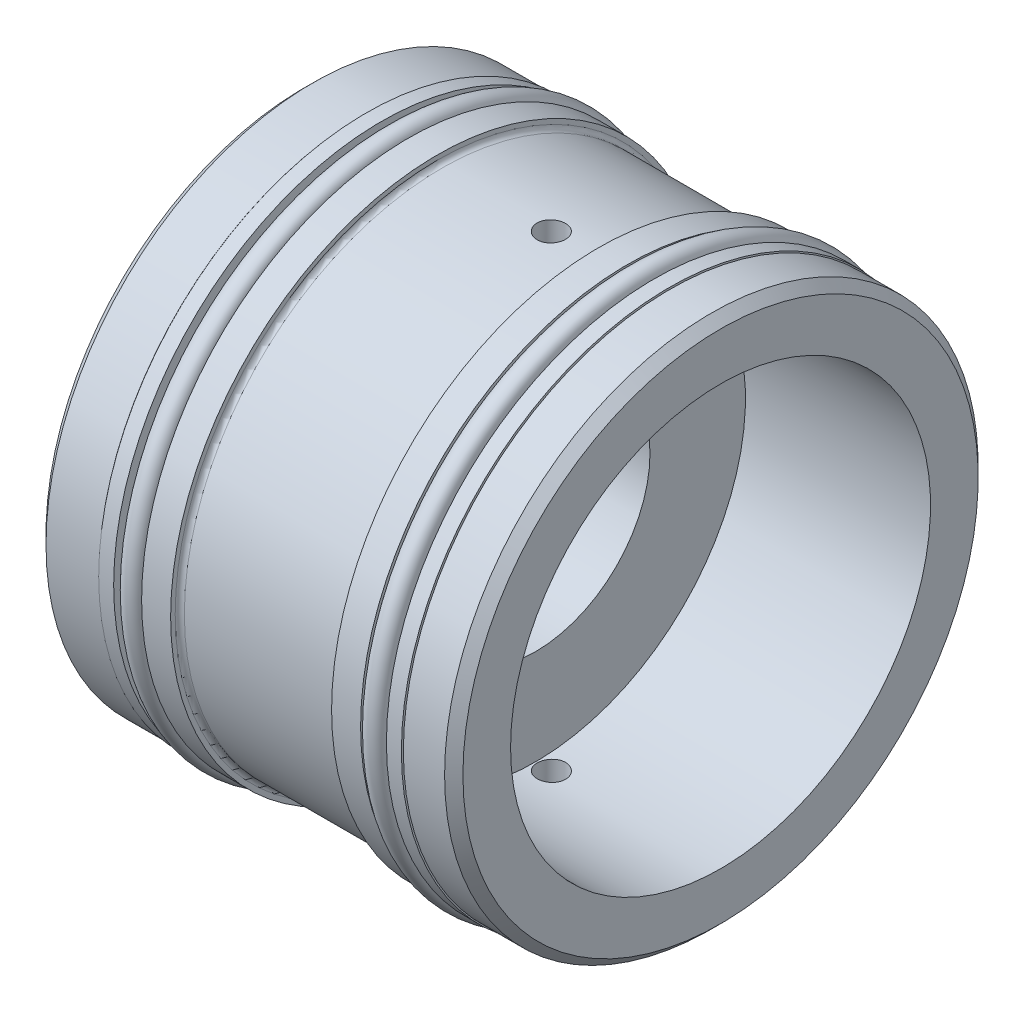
ISO-10303-21;
HEADER;
FILE_DESCRIPTION(('STEP AP214'),'2;1');
FILE_NAME('part.step','',(''),(''),'','','');
FILE_SCHEMA(('AUTOMOTIVE_DESIGN { 1 0 10303 214 1 1 1 1 }'));
ENDSEC;
DATA;
#1=APPLICATION_CONTEXT('core data for automotive mechanical design processes');
#2=APPLICATION_PROTOCOL_DEFINITION('international standard','automotive_design',2000,#1);
#3=PRODUCT_CONTEXT('',#1,'mechanical');
#4=PRODUCT('Part','Part','',(#3));
#5=PRODUCT_RELATED_PRODUCT_CATEGORY('part','',(#4));
#6=PRODUCT_DEFINITION_FORMATION('','',#4);
#7=PRODUCT_DEFINITION_CONTEXT('part definition',#1,'design');
#8=PRODUCT_DEFINITION('design','',#6,#7);
#9=PRODUCT_DEFINITION_SHAPE('','',#8);
#10=(LENGTH_UNIT() NAMED_UNIT(*) SI_UNIT(.MILLI.,.METRE.));
#11=(NAMED_UNIT(*) PLANE_ANGLE_UNIT() SI_UNIT($,.RADIAN.));
#12=(NAMED_UNIT(*) SI_UNIT($,.STERADIAN.) SOLID_ANGLE_UNIT());
#13=UNCERTAINTY_MEASURE_WITH_UNIT(LENGTH_MEASURE(1.E-05),#10,'distance_accuracy_value','');
#14=(GEOMETRIC_REPRESENTATION_CONTEXT(3) GLOBAL_UNCERTAINTY_ASSIGNED_CONTEXT((#13)) GLOBAL_UNIT_ASSIGNED_CONTEXT((#10,
#11,#12)) REPRESENTATION_CONTEXT('',''));
#15=CARTESIAN_POINT('',(0.,0.,0.));
#16=DIRECTION('',(0.,0.,1.));
#17=DIRECTION('',(1.,0.,0.));
#18=AXIS2_PLACEMENT_3D('',#15,#16,#17);
#19=CARTESIAN_POINT('',(0.,0.,0.));
#20=DIRECTION('',(-1.,0.,0.));
#21=DIRECTION('',(0.,0.,1.));
#22=AXIS2_PLACEMENT_3D('',#19,#20,#21);
#23=CYLINDRICAL_SURFACE('',#22,20.9296);
#24=CARTESIAN_POINT('',(10.9138071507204,0.,0.));
#25=DIRECTION('',(-1.,0.,0.));
#26=DIRECTION('',(0.,0.,1.));
#27=AXIS2_PLACEMENT_3D('',#24,#25,#26);
#28=CIRCLE('',#27,20.9296);
#29=CARTESIAN_POINT('',(10.9138071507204,0.,20.9296));
#30=VERTEX_POINT('',#29);
#31=EDGE_CURVE('E146',#30,#30,#28,.T.);
#32=ORIENTED_EDGE('',*,*,#31,.F.);
#33=EDGE_LOOP('',(#32));
#34=FACE_BOUND('',#33,.T.);
#35=CARTESIAN_POINT('',(11.8237,0.,0.));
#36=DIRECTION('',(1.,0.,0.));
#37=DIRECTION('',(0.,0.,-1.));
#38=AXIS2_PLACEMENT_3D('',#35,#36,#37);
#39=CIRCLE('',#38,20.9296);
#40=CARTESIAN_POINT('',(11.8237,0.,-20.9296));
#41=VERTEX_POINT('',#40);
#42=EDGE_CURVE('E10',#41,#41,#39,.T.);
#43=ORIENTED_EDGE('',*,*,#42,.F.);
#44=EDGE_LOOP('',(#43));
#45=FACE_BOUND('',#44,.T.);
#46=ADVANCED_FACE('F31',(#34,#45),#23,.T.);
#47=CARTESIAN_POINT('',(13.1445,0.,0.));
#48=DIRECTION('',(-1.,0.,0.));
#49=DIRECTION('',(0.,0.,1.));
#50=AXIS2_PLACEMENT_3D('',#47,#48,#49);
#51=CIRCLE('',#50,20.9296);
#52=CARTESIAN_POINT('',(13.1445,0.,20.9296));
#53=VERTEX_POINT('',#52);
#54=EDGE_CURVE('E198',#53,#53,#51,.T.);
#55=ORIENTED_EDGE('',*,*,#54,.T.);
#56=EDGE_LOOP('',(#55));
#57=FACE_BOUND('',#56,.T.);
#58=CARTESIAN_POINT('',(13.0683,0.,0.));
#59=DIRECTION('',(-1.,0.,0.));
#60=DIRECTION('',(0.,0.,1.));
#61=AXIS2_PLACEMENT_3D('',#58,#59,#60);
#62=CIRCLE('',#61,20.9296);
#63=CARTESIAN_POINT('',(13.0683,0.,20.9296));
#64=VERTEX_POINT('',#63);
#65=EDGE_CURVE('E43',#64,#64,#62,.T.);
#66=ORIENTED_EDGE('',*,*,#65,.F.);
#67=EDGE_LOOP('',(#66));
#68=FACE_BOUND('',#67,.T.);
#69=ADVANCED_FACE('F118',(#57,#68),#23,.T.);
#70=CARTESIAN_POINT('',(9.5885,0.,0.));
#71=DIRECTION('',(-1.,0.,0.));
#72=DIRECTION('',(0.,0.,1.));
#73=AXIS2_PLACEMENT_3D('',#70,#71,#72);
#74=CIRCLE('',#73,20.9296);
#75=CARTESIAN_POINT('',(9.5885,0.,20.9296));
#76=VERTEX_POINT('',#75);
#77=EDGE_CURVE('E142',#76,#76,#74,.T.);
#78=ORIENTED_EDGE('',*,*,#77,.F.);
#79=EDGE_LOOP('',(#78));
#80=FACE_BOUND('',#79,.T.);
#81=CARTESIAN_POINT('',(10.1935928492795,0.,0.));
#82=DIRECTION('',(1.,0.,0.));
#83=DIRECTION('',(0.,0.,-1.));
#84=AXIS2_PLACEMENT_3D('',#81,#82,#83);
#85=CIRCLE('',#84,20.9296);
#86=CARTESIAN_POINT('',(10.1935928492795,0.,-20.9296));
#87=VERTEX_POINT('',#86);
#88=EDGE_CURVE('E48',#87,#87,#85,.T.);
#89=ORIENTED_EDGE('',*,*,#88,.F.);
#90=EDGE_LOOP('',(#89));
#91=FACE_BOUND('',#90,.T.);
#92=ADVANCED_FACE('F121',(#80,#91),#23,.T.);
#93=CARTESIAN_POINT('',(0.,0.,0.));
#94=DIRECTION('',(-1.,0.,0.));
#95=DIRECTION('',(0.,0.,1.));
#96=AXIS2_PLACEMENT_3D('',#93,#94,#95);
#97=CYLINDRICAL_SURFACE('',#96,20.9296);
#98=CARTESIAN_POINT('',(-10.8585,0.,0.));
#99=DIRECTION('',(-1.,0.,0.));
#100=DIRECTION('',(0.,0.,1.));
#101=AXIS2_PLACEMENT_3D('',#98,#99,#100);
#102=CIRCLE('',#101,20.9296);
#103=CARTESIAN_POINT('',(-10.8585,0.,20.9296));
#104=VERTEX_POINT('',#103);
#105=EDGE_CURVE('E159',#104,#104,#102,.T.);
#106=ORIENTED_EDGE('',*,*,#105,.F.);
#107=EDGE_LOOP('',(#106));
#108=FACE_BOUND('',#107,.T.);
#109=CARTESIAN_POINT('',(-9.94860715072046,0.,0.));
#110=DIRECTION('',(1.,0.,0.));
#111=DIRECTION('',(0.,0.,-1.));
#112=AXIS2_PLACEMENT_3D('',#109,#110,#111);
#113=CIRCLE('',#112,20.9296);
#114=CARTESIAN_POINT('',(-9.94860715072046,0.,-20.9296));
#115=VERTEX_POINT('',#114);
#116=EDGE_CURVE('E148',#115,#115,#113,.T.);
#117=ORIENTED_EDGE('',*,*,#116,.F.);
#118=EDGE_LOOP('',(#117));
#119=FACE_BOUND('',#118,.T.);
#120=ADVANCED_FACE('F131',(#108,#119),#97,.T.);
#121=CARTESIAN_POINT('',(-8.6233,0.,0.));
#122=DIRECTION('',(-1.,0.,0.));
#123=DIRECTION('',(0.,0.,1.));
#124=AXIS2_PLACEMENT_3D('',#121,#122,#123);
#125=CIRCLE('',#124,20.9296);
#126=CARTESIAN_POINT('',(-8.6233,0.,20.9296));
#127=VERTEX_POINT('',#126);
#128=EDGE_CURVE('E214',#127,#127,#125,.T.);
#129=ORIENTED_EDGE('',*,*,#128,.T.);
#130=EDGE_LOOP('',(#129));
#131=FACE_BOUND('',#130,.T.);
#132=CARTESIAN_POINT('',(-9.22839284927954,0.,0.));
#133=DIRECTION('',(-1.,0.,0.));
#134=DIRECTION('',(0.,0.,1.));
#135=AXIS2_PLACEMENT_3D('',#132,#133,#134);
#136=CIRCLE('',#135,20.9296);
#137=CARTESIAN_POINT('',(-9.22839284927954,0.,20.9296));
#138=VERTEX_POINT('',#137);
#139=EDGE_CURVE('E153',#138,#138,#136,.T.);
#140=ORIENTED_EDGE('',*,*,#139,.F.);
#141=EDGE_LOOP('',(#140));
#142=FACE_BOUND('',#141,.T.);
#143=ADVANCED_FACE('F136',(#131,#142),#97,.T.);
#144=CARTESIAN_POINT('',(-12.1793,0.,0.));
#145=DIRECTION('',(-1.,0.,0.));
#146=DIRECTION('',(0.,0.,1.));
#147=AXIS2_PLACEMENT_3D('',#144,#145,#146);
#148=CIRCLE('',#147,20.9296);
#149=CARTESIAN_POINT('',(-12.1793,0.,20.9296));
#150=VERTEX_POINT('',#149);
#151=EDGE_CURVE('E217',#150,#150,#148,.T.);
#152=ORIENTED_EDGE('',*,*,#151,.F.);
#153=EDGE_LOOP('',(#152));
#154=FACE_BOUND('',#153,.T.);
#155=CARTESIAN_POINT('',(-12.1031,0.,0.));
#156=DIRECTION('',(1.,0.,0.));
#157=DIRECTION('',(0.,0.,-1.));
#158=AXIS2_PLACEMENT_3D('',#155,#156,#157);
#159=CIRCLE('',#158,20.9296);
#160=CARTESIAN_POINT('',(-12.1031,0.,-20.9296));
#161=VERTEX_POINT('',#160);
#162=EDGE_CURVE('E156',#161,#161,#159,.T.);
#163=ORIENTED_EDGE('',*,*,#162,.F.);
#164=EDGE_LOOP('',(#163));
#165=FACE_BOUND('',#164,.T.);
#166=ADVANCED_FACE('F97',(#154,#165),#97,.T.);
#167=CARTESIAN_POINT('',(0.,0.,0.));
#168=DIRECTION('',(-1.,0.,0.));
#169=DIRECTION('',(0.,0.,1.));
#170=AXIS2_PLACEMENT_3D('',#167,#168,#169);
#171=CYLINDRICAL_SURFACE('',#170,9.525);
#172=CARTESIAN_POINT('',(1.9431,0.,0.));
#173=DIRECTION('',(-1.,0.,0.));
#174=DIRECTION('',(0.,0.,1.));
#175=AXIS2_PLACEMENT_3D('',#172,#173,#174);
#176=CIRCLE('',#175,9.525);
#177=CARTESIAN_POINT('',(1.9431,0.,9.525));
#178=VERTEX_POINT('',#177);
#179=EDGE_CURVE('E186',#178,#178,#176,.T.);
#180=ORIENTED_EDGE('',*,*,#179,.F.);
#181=EDGE_LOOP('',(#180));
#182=FACE_BOUND('',#181,.T.);
#183=CARTESIAN_POINT('',(-17.3355,0.,0.));
#184=DIRECTION('',(-1.,0.,0.));
#185=DIRECTION('',(0.,0.,1.));
#186=AXIS2_PLACEMENT_3D('',#183,#184,#185);
#187=CIRCLE('',#186,9.525);
#188=CARTESIAN_POINT('',(-17.3355,0.,9.525));
#189=VERTEX_POINT('',#188);
#190=EDGE_CURVE('E223',#189,#189,#187,.T.);
#191=ORIENTED_EDGE('',*,*,#190,.T.);
#192=EDGE_LOOP('',(#191));
#193=FACE_BOUND('',#192,.T.);
#194=ADVANCED_FACE('F93',(#182,#193),#171,.F.);
#195=CARTESIAN_POINT('',(1.9431,9.525,0.));
#196=DIRECTION('',(-1.,0.,0.));
#197=DIRECTION('',(0.,0.,1.));
#198=AXIS2_PLACEMENT_3D('',#195,#196,#197);
#199=PLANE('',#198);
#200=CARTESIAN_POINT('',(1.9431,0.,0.));
#201=DIRECTION('',(-1.,0.,0.));
#202=DIRECTION('',(0.,0.,1.));
#203=AXIS2_PLACEMENT_3D('',#200,#201,#202);
#204=CIRCLE('',#203,17.4625);
#205=CARTESIAN_POINT('',(1.9431,0.,17.4625));
#206=VERTEX_POINT('',#205);
#207=EDGE_CURVE('E189',#206,#206,#204,.T.);
#208=ORIENTED_EDGE('',*,*,#207,.F.);
#209=EDGE_LOOP('',(#208));
#210=FACE_BOUND('',#209,.T.);
#211=ORIENTED_EDGE('',*,*,#179,.T.);
#212=EDGE_LOOP('',(#211));
#213=FACE_BOUND('',#212,.T.);
#214=ADVANCED_FACE('F87',(#210,#213),#199,.F.);
#215=CARTESIAN_POINT('',(0.,0.,0.));
#216=DIRECTION('',(-1.,0.,0.));
#217=DIRECTION('',(0.,0.,1.));
#218=AXIS2_PLACEMENT_3D('',#215,#216,#217);
#219=CYLINDRICAL_SURFACE('',#218,17.4625);
#220=CARTESIAN_POINT('',(3.2639,-17.4225115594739,1.1811));
#221=CARTESIAN_POINT('',(3.19763855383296,-17.4225120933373,1.18109708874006));
#222=CARTESIAN_POINT('',(3.13133099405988,-17.4228936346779,1.1755052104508));
#223=CARTESIAN_POINT('',(3.00054761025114,-17.4243787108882,1.15327882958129));
#224=CARTESIAN_POINT('',(2.93607399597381,-17.4254830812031,1.13663154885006));
#225=CARTESIAN_POINT('',(2.81087179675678,-17.4282881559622,1.0927754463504));
#226=CARTESIAN_POINT('',(2.75014122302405,-17.4299885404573,1.06557229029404));
#227=CARTESIAN_POINT('',(2.63412380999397,-17.4337936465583,1.00138601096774));
#228=CARTESIAN_POINT('',(2.57883574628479,-17.4358982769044,0.964405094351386));
#229=CARTESIAN_POINT('',(2.47516116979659,-17.4402788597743,0.881642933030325));
#230=CARTESIAN_POINT('',(2.42678537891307,-17.442555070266,0.835848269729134));
#231=CARTESIAN_POINT('',(2.33840041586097,-17.4470199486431,0.736786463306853));
#232=CARTESIAN_POINT('',(2.29839159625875,-17.4492086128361,0.683519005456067));
#233=CARTESIAN_POINT('',(2.22784263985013,-17.4532540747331,0.570962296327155));
#234=CARTESIAN_POINT('',(2.19731147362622,-17.455110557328,0.511667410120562));
#235=CARTESIAN_POINT('',(2.14664191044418,-17.4582797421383,0.388778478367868));
#236=CARTESIAN_POINT('',(2.12650338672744,-17.4595924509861,0.325184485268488));
#237=CARTESIAN_POINT('',(2.09722078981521,-17.4615243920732,0.195606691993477));
#238=CARTESIAN_POINT('',(2.08805978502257,-17.4621446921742,0.129626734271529));
#239=CARTESIAN_POINT('',(2.08093997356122,-17.4626255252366,-0.00293710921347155));
#240=CARTESIAN_POINT('',(2.0829810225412,-17.4624860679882,-0.0695209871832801));
#241=CARTESIAN_POINT('',(2.09819344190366,-17.4614639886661,-0.201287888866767));
#242=CARTESIAN_POINT('',(2.1113466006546,-17.4605825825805,-0.26647302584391));
#243=CARTESIAN_POINT('',(2.14838159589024,-17.4581772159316,-0.393708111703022));
#244=CARTESIAN_POINT('',(2.17226350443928,-17.4566532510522,-0.455758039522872));
#245=CARTESIAN_POINT('',(2.23009863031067,-17.4531322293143,-0.575019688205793));
#246=CARTESIAN_POINT('',(2.26406007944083,-17.4511347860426,-0.632227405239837));
#247=CARTESIAN_POINT('',(2.34108426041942,-17.4468915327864,-0.740136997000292));
#248=CARTESIAN_POINT('',(2.38414711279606,-17.4446457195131,-0.790838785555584));
#249=CARTESIAN_POINT('',(2.47825451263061,-17.4401530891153,-0.884403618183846));
#250=CARTESIAN_POINT('',(2.52931487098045,-17.4379062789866,-0.927250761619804));
#251=CARTESIAN_POINT('',(2.63791253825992,-17.4336694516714,-1.00376738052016));
#252=CARTESIAN_POINT('',(2.6954498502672,-17.4316794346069,-1.03743685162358));
#253=CARTESIAN_POINT('',(2.81537849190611,-17.4281809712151,-1.09464135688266));
#254=CARTESIAN_POINT('',(2.87777015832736,-17.4266725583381,-1.11817568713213));
#255=CARTESIAN_POINT('',(3.00563165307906,-17.4243085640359,-1.15443070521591));
#256=CARTESIAN_POINT('',(3.07110143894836,-17.4234529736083,-1.1671515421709));
#257=CARTESIAN_POINT('',(3.20312193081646,-17.4224928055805,-1.18139859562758));
#258=CARTESIAN_POINT('',(3.26967023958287,-17.4223867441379,-1.1829469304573));
#259=CARTESIAN_POINT('',(3.40208070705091,-17.422933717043,-1.1748628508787));
#260=CARTESIAN_POINT('',(3.46794286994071,-17.4235867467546,-1.16523050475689));
#261=CARTESIAN_POINT('',(3.59704870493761,-17.4255769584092,-1.13507687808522));
#262=CARTESIAN_POINT('',(3.66029477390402,-17.4269134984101,-1.11456581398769));
#263=CARTESIAN_POINT('',(3.78244713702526,-17.4301195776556,-1.06324734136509));
#264=CARTESIAN_POINT('',(3.84135338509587,-17.431989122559,-1.03243982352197));
#265=CARTESIAN_POINT('',(3.95325548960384,-17.4360541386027,-0.96134655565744));
#266=CARTESIAN_POINT('',(4.00624192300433,-17.4382501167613,-0.921046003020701));
#267=CARTESIAN_POINT('',(4.10470531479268,-17.4427187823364,-0.832132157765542));
#268=CARTESIAN_POINT('',(4.15018218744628,-17.4449914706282,-0.78351877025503));
#269=CARTESIAN_POINT('',(4.23241042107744,-17.449361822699,-0.679263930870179));
#270=CARTESIAN_POINT('',(4.26914745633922,-17.4514591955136,-0.623611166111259));
#271=CARTESIAN_POINT('',(4.33275509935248,-17.4552384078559,-0.50691412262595));
#272=CARTESIAN_POINT('',(4.3596257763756,-17.4569202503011,-0.445869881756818));
#273=CARTESIAN_POINT('',(4.40271309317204,-17.4596775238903,-0.320175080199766));
#274=CARTESIAN_POINT('',(4.41893875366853,-17.4607534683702,-0.255527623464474));
#275=CARTESIAN_POINT('',(4.44030496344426,-17.4621797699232,-0.124418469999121));
#276=CARTESIAN_POINT('',(4.44544564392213,-17.4625301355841,-0.0579567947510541));
#277=CARTESIAN_POINT('',(4.4444946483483,-17.4624658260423,0.0747525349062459));
#278=CARTESIAN_POINT('',(4.43842537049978,-17.4620526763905,0.141000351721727));
#279=CARTESIAN_POINT('',(4.41527324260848,-17.4605108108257,0.27153386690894));
#280=CARTESIAN_POINT('',(4.39819037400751,-17.459382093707,0.335819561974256));
#281=CARTESIAN_POINT('',(4.35350119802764,-17.4565359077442,0.460606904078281));
#282=CARTESIAN_POINT('',(4.3258950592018,-17.4548184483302,0.52110861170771));
#283=CARTESIAN_POINT('',(4.26094591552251,-17.4509874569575,0.636621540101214));
#284=CARTESIAN_POINT('',(4.22360314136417,-17.4488739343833,0.691632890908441));
#285=CARTESIAN_POINT('',(4.14015747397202,-17.4444834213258,0.794717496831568));
#286=CARTESIAN_POINT('',(4.09403826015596,-17.4422061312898,0.842777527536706));
#287=CARTESIAN_POINT('',(3.9943732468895,-17.4377472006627,0.930490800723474));
#288=CARTESIAN_POINT('',(3.94082563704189,-17.4355655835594,0.970141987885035));
#289=CARTESIAN_POINT('',(3.82775340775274,-17.4315416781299,1.03994662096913));
#290=CARTESIAN_POINT('',(3.76822065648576,-17.4296998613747,1.07008690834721));
#291=CARTESIAN_POINT('',(3.6449698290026,-17.4265700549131,1.11990682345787));
#292=CARTESIAN_POINT('',(3.5812567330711,-17.4252814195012,1.13959865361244));
#293=CARTESIAN_POINT('',(3.47494734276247,-17.4237402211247,1.16286709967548));
#294=CARTESIAN_POINT('',(3.43303752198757,-17.4232815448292,1.16969554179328));
#295=CARTESIAN_POINT('',(3.34872476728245,-17.4226670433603,1.17881292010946));
#296=CARTESIAN_POINT('',(3.30632183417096,-17.4225112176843,1.18110186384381));
#297=CARTESIAN_POINT('',(3.2639,-17.4225115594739,1.1811));
#298=B_SPLINE_CURVE_WITH_KNOTS('',3,(#220,#221,#222,#223,#224,#225,#226,#227,#228,#229,#230,
#231,#232,#233,#234,#235,#236,#237,#238,#239,#240,#241,#242,#243,#244,#245,#246,#247,#248,#249,
#250,#251,#252,#253,#254,#255,#256,#257,#258,#259,#260,#261,#262,#263,#264,#265,#266,#267,#268,
#269,#270,#271,#272,#273,#274,#275,#276,#277,#278,#279,#280,#281,#282,#283,#284,#285,#286,#287,
#288,#289,#290,#291,#292,#293,#294,#295,#296,#297),.UNSPECIFIED.,.T.,.F.,(4,2,2,2,2,2,2,2,2,2,2,
2,2,2,2,2,2,2,2,2,2,2,2,2,2,2,2,2,2,2,2,2,2,2,2,2,2,2,4),(0.,0.198629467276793,0.39748891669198,
0.596241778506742,0.794949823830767,0.993962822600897,1.19298420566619,1.39219339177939,
1.59140014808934,1.7902992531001,1.98919579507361,2.18776699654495,2.38633953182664,
2.58507468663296,2.78381247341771,2.98294823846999,3.18208409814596,3.38123378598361,
3.58038072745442,3.7791333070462,3.977884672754,4.17644971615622,4.3750168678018,
4.5738957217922,4.77277684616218,4.97198175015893,5.17118525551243,5.37021973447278,
5.56925185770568,5.76788673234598,5.9665219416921,6.16515396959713,6.36378129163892,
6.56278165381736,6.7618306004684,6.9611537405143,7.16024358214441,7.2874101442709,
7.41457649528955),.UNSPECIFIED.);
#299=CARTESIAN_POINT('',(3.2639,-17.4225115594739,1.1811));
#300=VERTEX_POINT('',#299);
#301=EDGE_CURVE('E77',#300,#300,#298,.T.);
#302=ORIENTED_EDGE('',*,*,#301,.T.);
#303=EDGE_LOOP('',(#302));
#304=FACE_BOUND('',#303,.T.);
#305=CARTESIAN_POINT('',(3.2639,17.4225115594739,1.1811));
#306=CARTESIAN_POINT('',(3.33016144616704,17.4225120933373,1.18109708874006));
#307=CARTESIAN_POINT('',(3.39646900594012,17.4228936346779,1.1755052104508));
#308=CARTESIAN_POINT('',(3.52725238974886,17.4243787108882,1.15327882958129));
#309=CARTESIAN_POINT('',(3.59172600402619,17.4254830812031,1.13663154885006));
#310=CARTESIAN_POINT('',(3.71692820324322,17.4282881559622,1.0927754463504));
#311=CARTESIAN_POINT('',(3.77765877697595,17.4299885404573,1.06557229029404));
#312=CARTESIAN_POINT('',(3.89367619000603,17.4337936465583,1.00138601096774));
#313=CARTESIAN_POINT('',(3.94896425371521,17.4358982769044,0.964405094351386));
#314=CARTESIAN_POINT('',(4.05263883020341,17.4402788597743,0.881642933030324));
#315=CARTESIAN_POINT('',(4.10101462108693,17.442555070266,0.835848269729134));
#316=CARTESIAN_POINT('',(4.18939958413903,17.4470199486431,0.736786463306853));
#317=CARTESIAN_POINT('',(4.22940840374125,17.4492086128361,0.683519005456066));
#318=CARTESIAN_POINT('',(4.29995736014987,17.4532540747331,0.570962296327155));
#319=CARTESIAN_POINT('',(4.33048852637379,17.455110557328,0.511667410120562));
#320=CARTESIAN_POINT('',(4.38115808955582,17.4582797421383,0.388778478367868));
#321=CARTESIAN_POINT('',(4.40129661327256,17.4595924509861,0.325184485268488));
#322=CARTESIAN_POINT('',(4.43057921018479,17.4615243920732,0.195606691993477));
#323=CARTESIAN_POINT('',(4.43974021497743,17.4621446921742,0.129626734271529));
#324=CARTESIAN_POINT('',(4.44686002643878,17.4626255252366,-0.00293710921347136));
#325=CARTESIAN_POINT('',(4.4448189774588,17.4624860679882,-0.0695209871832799));
#326=CARTESIAN_POINT('',(4.42960655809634,17.4614639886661,-0.201287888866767));
#327=CARTESIAN_POINT('',(4.4164533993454,17.4605825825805,-0.266473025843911));
#328=CARTESIAN_POINT('',(4.37941840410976,17.4581772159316,-0.393708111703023));
#329=CARTESIAN_POINT('',(4.35553649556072,17.4566532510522,-0.455758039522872));
#330=CARTESIAN_POINT('',(4.29770136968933,17.4531322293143,-0.575019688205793));
#331=CARTESIAN_POINT('',(4.26373992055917,17.4511347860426,-0.632227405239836));
#332=CARTESIAN_POINT('',(4.18671573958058,17.4468915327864,-0.740136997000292));
#333=CARTESIAN_POINT('',(4.14365288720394,17.4446457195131,-0.790838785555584));
#334=CARTESIAN_POINT('',(4.04954548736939,17.4401530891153,-0.884403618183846));
#335=CARTESIAN_POINT('',(3.99848512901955,17.4379062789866,-0.927250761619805));
#336=CARTESIAN_POINT('',(3.88988746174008,17.4336694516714,-1.00376738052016));
#337=CARTESIAN_POINT('',(3.8323501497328,17.4316794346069,-1.03743685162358));
#338=CARTESIAN_POINT('',(3.71242150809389,17.4281809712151,-1.09464135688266));
#339=CARTESIAN_POINT('',(3.65002984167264,17.4266725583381,-1.11817568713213));
#340=CARTESIAN_POINT('',(3.52216834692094,17.4243085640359,-1.15443070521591));
#341=CARTESIAN_POINT('',(3.45669856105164,17.4234529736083,-1.1671515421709));
#342=CARTESIAN_POINT('',(3.32467806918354,17.4224928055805,-1.18139859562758));
#343=CARTESIAN_POINT('',(3.25812976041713,17.4223867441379,-1.1829469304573));
#344=CARTESIAN_POINT('',(3.12571929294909,17.422933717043,-1.1748628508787));
#345=CARTESIAN_POINT('',(3.05985713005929,17.4235867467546,-1.16523050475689));
#346=CARTESIAN_POINT('',(2.93075129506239,17.4255769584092,-1.13507687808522));
#347=CARTESIAN_POINT('',(2.86750522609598,17.4269134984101,-1.11456581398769));
#348=CARTESIAN_POINT('',(2.74535286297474,17.4301195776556,-1.06324734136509));
#349=CARTESIAN_POINT('',(2.68644661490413,17.431989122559,-1.03243982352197));
#350=CARTESIAN_POINT('',(2.57454451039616,17.4360541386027,-0.96134655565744));
#351=CARTESIAN_POINT('',(2.52155807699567,17.4382501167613,-0.9210460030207));
#352=CARTESIAN_POINT('',(2.42309468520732,17.4427187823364,-0.832132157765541));
#353=CARTESIAN_POINT('',(2.37761781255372,17.4449914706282,-0.78351877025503));
#354=CARTESIAN_POINT('',(2.29538957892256,17.449361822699,-0.679263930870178));
#355=CARTESIAN_POINT('',(2.25865254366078,17.4514591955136,-0.623611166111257));
#356=CARTESIAN_POINT('',(2.19504490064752,17.4552384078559,-0.506914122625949));
#357=CARTESIAN_POINT('',(2.16817422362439,17.4569202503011,-0.445869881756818));
#358=CARTESIAN_POINT('',(2.12508690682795,17.4596775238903,-0.320175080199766));
#359=CARTESIAN_POINT('',(2.10886124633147,17.4607534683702,-0.255527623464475));
#360=CARTESIAN_POINT('',(2.08749503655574,17.4621797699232,-0.124418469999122));
#361=CARTESIAN_POINT('',(2.08235435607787,17.4625301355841,-0.0579567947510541));
#362=CARTESIAN_POINT('',(2.0833053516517,17.4624658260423,0.0747525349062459));
#363=CARTESIAN_POINT('',(2.08937462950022,17.4620526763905,0.141000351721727));
#364=CARTESIAN_POINT('',(2.11252675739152,17.4605108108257,0.27153386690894));
#365=CARTESIAN_POINT('',(2.12960962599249,17.459382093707,0.335819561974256));
#366=CARTESIAN_POINT('',(2.17429880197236,17.4565359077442,0.460606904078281));
#367=CARTESIAN_POINT('',(2.2019049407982,17.4548184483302,0.52110861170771));
#368=CARTESIAN_POINT('',(2.26685408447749,17.4509874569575,0.636621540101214));
#369=CARTESIAN_POINT('',(2.30419685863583,17.4488739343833,0.691632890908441));
#370=CARTESIAN_POINT('',(2.38764252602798,17.4444834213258,0.794717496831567));
#371=CARTESIAN_POINT('',(2.43376173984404,17.4422061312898,0.842777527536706));
#372=CARTESIAN_POINT('',(2.5334267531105,17.4377472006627,0.930490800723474));
#373=CARTESIAN_POINT('',(2.58697436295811,17.4355655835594,0.970141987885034));
#374=CARTESIAN_POINT('',(2.70004659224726,17.4315416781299,1.03994662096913));
#375=CARTESIAN_POINT('',(2.75957934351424,17.4296998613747,1.07008690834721));
#376=CARTESIAN_POINT('',(2.8828301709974,17.4265700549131,1.11990682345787));
#377=CARTESIAN_POINT('',(2.9465432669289,17.4252814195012,1.13959865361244));
#378=CARTESIAN_POINT('',(3.05285265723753,17.4237402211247,1.16286709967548));
#379=CARTESIAN_POINT('',(3.09476247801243,17.4232815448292,1.16969554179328));
#380=CARTESIAN_POINT('',(3.17907523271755,17.4226670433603,1.17881292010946));
#381=CARTESIAN_POINT('',(3.22147816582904,17.4225112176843,1.18110186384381));
#382=CARTESIAN_POINT('',(3.2639,17.4225115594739,1.1811));
#383=B_SPLINE_CURVE_WITH_KNOTS('',3,(#305,#306,#307,#308,#309,#310,#311,#312,#313,#314,#315,
#316,#317,#318,#319,#320,#321,#322,#323,#324,#325,#326,#327,#328,#329,#330,#331,#332,#333,#334,
#335,#336,#337,#338,#339,#340,#341,#342,#343,#344,#345,#346,#347,#348,#349,#350,#351,#352,#353,
#354,#355,#356,#357,#358,#359,#360,#361,#362,#363,#364,#365,#366,#367,#368,#369,#370,#371,#372,
#373,#374,#375,#376,#377,#378,#379,#380,#381,#382),.UNSPECIFIED.,.T.,.F.,(4,2,2,2,2,2,2,2,2,2,2,
2,2,2,2,2,2,2,2,2,2,2,2,2,2,2,2,2,2,2,2,2,2,2,2,2,2,2,4),(0.,0.198629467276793,0.39748891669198,
0.596241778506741,0.794949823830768,0.993962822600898,1.19298420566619,1.39219339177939,
1.59140014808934,1.7902992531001,1.98919579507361,2.18776699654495,2.38633953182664,
2.58507468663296,2.78381247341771,2.98294823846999,3.18208409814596,3.38123378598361,
3.58038072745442,3.7791333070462,3.977884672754,4.17644971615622,4.37501686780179,
4.5738957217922,4.77277684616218,4.97198175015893,5.17118525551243,5.37021973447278,
5.56925185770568,5.76788673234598,5.9665219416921,6.16515396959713,6.36378129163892,
6.56278165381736,6.7618306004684,6.9611537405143,7.1602435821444,7.28741014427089,
7.41457649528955),.UNSPECIFIED.);
#384=CARTESIAN_POINT('',(3.2639,17.4225115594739,1.1811));
#385=VERTEX_POINT('',#384);
#386=EDGE_CURVE('E72',#385,#385,#383,.T.);
#387=ORIENTED_EDGE('',*,*,#386,.T.);
#388=EDGE_LOOP('',(#387));
#389=FACE_BOUND('',#388,.T.);
#390=CARTESIAN_POINT('',(17.3355,0.,0.));
#391=DIRECTION('',(-1.,0.,0.));
#392=DIRECTION('',(0.,0.,1.));
#393=AXIS2_PLACEMENT_3D('',#390,#391,#392);
#394=CIRCLE('',#393,17.4625);
#395=CARTESIAN_POINT('',(17.3355,0.,17.4625));
#396=VERTEX_POINT('',#395);
#397=EDGE_CURVE('E192',#396,#396,#394,.T.);
#398=ORIENTED_EDGE('',*,*,#397,.F.);
#399=EDGE_LOOP('',(#398));
#400=FACE_BOUND('',#399,.T.);
#401=ORIENTED_EDGE('',*,*,#207,.T.);
#402=EDGE_LOOP('',(#401));
#403=FACE_BOUND('',#402,.T.);
#404=ADVANCED_FACE('F81',(#304,#389,#400,#403),#219,.F.);
#405=CARTESIAN_POINT('',(17.3355,22.1869,0.));
#406=DIRECTION('',(-1.,0.,0.));
#407=DIRECTION('',(0.,0.,1.));
#408=AXIS2_PLACEMENT_3D('',#405,#406,#407);
#409=PLANE('',#408);
#410=CARTESIAN_POINT('',(17.3355,0.,0.));
#411=DIRECTION('',(-1.,0.,0.));
#412=DIRECTION('',(0.,0.,1.));
#413=AXIS2_PLACEMENT_3D('',#410,#411,#412);
#414=CIRCLE('',#413,21.4249);
#415=CARTESIAN_POINT('',(17.3355,0.,21.4249));
#416=VERTEX_POINT('',#415);
#417=EDGE_CURVE('E168',#416,#416,#414,.F.);
#418=ORIENTED_EDGE('',*,*,#417,.T.);
#419=EDGE_LOOP('',(#418));
#420=FACE_BOUND('',#419,.T.);
#421=ORIENTED_EDGE('',*,*,#397,.T.);
#422=EDGE_LOOP('',(#421));
#423=FACE_BOUND('',#422,.T.);
#424=ADVANCED_FACE('F86',(#420,#423),#409,.F.);
#425=CARTESIAN_POINT('',(0.,0.,0.));
#426=DIRECTION('',(-1.,0.,0.));
#427=DIRECTION('',(0.,0.,1.));
#428=AXIS2_PLACEMENT_3D('',#425,#426,#427);
#429=CYLINDRICAL_SURFACE('',#428,22.1869);
#430=CARTESIAN_POINT('',(16.5735,0.,0.));
#431=DIRECTION('',(-1.,0.,0.));
#432=DIRECTION('',(0.,0.,1.));
#433=AXIS2_PLACEMENT_3D('',#430,#431,#432);
#434=CIRCLE('',#433,22.1869);
#435=CARTESIAN_POINT('',(16.5735,0.,22.1869));
#436=VERTEX_POINT('',#435);
#437=EDGE_CURVE('E171',#436,#436,#434,.T.);
#438=ORIENTED_EDGE('',*,*,#437,.T.);
#439=EDGE_LOOP('',(#438));
#440=FACE_BOUND('',#439,.T.);
#441=CARTESIAN_POINT('',(13.1445,0.,0.));
#442=DIRECTION('',(-1.,0.,0.));
#443=DIRECTION('',(0.,0.,1.));
#444=AXIS2_PLACEMENT_3D('',#441,#442,#443);
#445=CIRCLE('',#444,22.1869);
#446=CARTESIAN_POINT('',(13.1445,0.,22.1869));
#447=VERTEX_POINT('',#446);
#448=EDGE_CURVE('E195',#447,#447,#445,.T.);
#449=ORIENTED_EDGE('',*,*,#448,.F.);
#450=EDGE_LOOP('',(#449));
#451=FACE_BOUND('',#450,.T.);
#452=ADVANCED_FACE('F418',(#440,#451),#429,.T.);
#453=CARTESIAN_POINT('',(13.1445,22.1869,0.));
#454=DIRECTION('',(1.,0.,0.));
#455=DIRECTION('',(0.,0.,-1.));
#456=AXIS2_PLACEMENT_3D('',#453,#454,#455);
#457=PLANE('',#456);
#458=ORIENTED_EDGE('',*,*,#54,.F.);
#459=EDGE_LOOP('',(#458));
#460=FACE_BOUND('',#459,.T.);
#461=ORIENTED_EDGE('',*,*,#448,.T.);
#462=EDGE_LOOP('',(#461));
#463=FACE_BOUND('',#462,.T.);
#464=ADVANCED_FACE('F426',(#460,#463),#457,.F.);
#465=CARTESIAN_POINT('',(9.5885,20.9296,0.));
#466=DIRECTION('',(-1.,0.,0.));
#467=DIRECTION('',(0.,0.,1.));
#468=AXIS2_PLACEMENT_3D('',#465,#466,#467);
#469=PLANE('',#468);
#470=CARTESIAN_POINT('',(9.5885,0.,0.));
#471=DIRECTION('',(-1.,0.,0.));
#472=DIRECTION('',(0.,0.,1.));
#473=AXIS2_PLACEMENT_3D('',#470,#471,#472);
#474=CIRCLE('',#473,22.1869);
#475=CARTESIAN_POINT('',(9.5885,0.,22.1869));
#476=VERTEX_POINT('',#475);
#477=EDGE_CURVE('E202',#476,#476,#474,.T.);
#478=ORIENTED_EDGE('',*,*,#477,.F.);
#479=EDGE_LOOP('',(#478));
#480=FACE_BOUND('',#479,.T.);
#481=ORIENTED_EDGE('',*,*,#77,.T.);
#482=EDGE_LOOP('',(#481));
#483=FACE_BOUND('',#482,.T.);
#484=ADVANCED_FACE('F433',(#480,#483),#469,.F.);
#485=CARTESIAN_POINT('',(0.,0.,0.));
#486=DIRECTION('',(-1.,0.,0.));
#487=DIRECTION('',(0.,0.,1.));
#488=AXIS2_PLACEMENT_3D('',#485,#486,#487);
#489=CYLINDRICAL_SURFACE('',#488,22.1869);
#490=CARTESIAN_POINT('',(7.1755,0.,0.));
#491=DIRECTION('',(-1.,0.,0.));
#492=DIRECTION('',(0.,0.,1.));
#493=AXIS2_PLACEMENT_3D('',#490,#491,#492);
#494=CIRCLE('',#493,22.1869);
#495=CARTESIAN_POINT('',(7.1755,0.,22.1869));
#496=VERTEX_POINT('',#495);
#497=EDGE_CURVE('E205',#496,#496,#494,.T.);
#498=ORIENTED_EDGE('',*,*,#497,.F.);
#499=EDGE_LOOP('',(#498));
#500=FACE_BOUND('',#499,.T.);
#501=ORIENTED_EDGE('',*,*,#477,.T.);
#502=EDGE_LOOP('',(#501));
#503=FACE_BOUND('',#502,.T.);
#504=ADVANCED_FACE('F293',(#500,#503),#489,.T.);
#505=CARTESIAN_POINT('',(7.1755,22.1869,0.));
#506=DIRECTION('',(1.,0.,0.));
#507=DIRECTION('',(0.,0.,-1.));
#508=AXIS2_PLACEMENT_3D('',#505,#506,#507);
#509=PLANE('',#508);
#510=CARTESIAN_POINT('',(7.1755,0.,0.));
#511=DIRECTION('',(1.,0.,0.));
#512=DIRECTION('',(0.,0.,-1.));
#513=AXIS2_PLACEMENT_3D('',#510,#511,#512);
#514=CIRCLE('',#513,21.8059);
#515=CARTESIAN_POINT('',(7.1755,0.,-21.8059));
#516=VERTEX_POINT('',#515);
#517=EDGE_CURVE('E177',#516,#516,#514,.T.);
#518=ORIENTED_EDGE('',*,*,#517,.T.);
#519=EDGE_LOOP('',(#518));
#520=FACE_BOUND('',#519,.T.);
#521=ORIENTED_EDGE('',*,*,#497,.T.);
#522=EDGE_LOOP('',(#521));
#523=FACE_BOUND('',#522,.T.);
#524=ADVANCED_FACE('F283',(#520,#523),#509,.F.);
#525=CARTESIAN_POINT('',(0.,0.,0.));
#526=DIRECTION('',(-1.,0.,0.));
#527=DIRECTION('',(0.,0.,1.));
#528=AXIS2_PLACEMENT_3D('',#525,#526,#527);
#529=CYLINDRICAL_SURFACE('',#528,21.4249);
#530=CARTESIAN_POINT('',(3.2639,-21.3923197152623,1.1811));
#531=CARTESIAN_POINT('',(3.3301888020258,-21.3923201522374,1.18109707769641));
#532=CARTESIAN_POINT('',(3.39652438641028,-21.3926311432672,1.17550060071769));
#533=CARTESIAN_POINT('',(3.5273649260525,-21.393841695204,1.15325488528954));
#534=CARTESIAN_POINT('',(3.59186764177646,-21.3947419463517,1.13659268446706));
#535=CARTESIAN_POINT('',(3.71712819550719,-21.3970287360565,1.09269462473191));
#536=CARTESIAN_POINT('',(3.77788794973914,-21.3984150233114,1.06546422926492));
#537=CARTESIAN_POINT('',(3.89395795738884,-21.4015173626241,1.0012113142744));
#538=CARTESIAN_POINT('',(3.94926947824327,-21.4032333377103,0.964191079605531));
#539=CARTESIAN_POINT('',(4.05295557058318,-21.4068040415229,0.881360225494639));
#540=CARTESIAN_POINT('',(4.10132276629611,-21.4086589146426,0.835540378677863));
#541=CARTESIAN_POINT('',(4.18968425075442,-21.4122970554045,0.736429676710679));
#542=CARTESIAN_POINT('',(4.2296781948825,-21.4140803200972,0.683138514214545));
#543=CARTESIAN_POINT('',(4.30017919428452,-21.4173754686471,0.570558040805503));
#544=CARTESIAN_POINT('',(4.33068035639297,-21.4188871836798,0.511265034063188));
#545=CARTESIAN_POINT('',(4.38129219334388,-21.4214674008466,0.38838996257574));
#546=CARTESIAN_POINT('',(4.4014029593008,-21.4225359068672,0.324807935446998));
#547=CARTESIAN_POINT('',(4.43064324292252,-21.4241083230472,0.195228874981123));
#548=CARTESIAN_POINT('',(4.43978401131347,-21.4246128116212,0.129234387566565));
#549=CARTESIAN_POINT('',(4.44685955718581,-21.4250022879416,-0.00335405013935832));
#550=CARTESIAN_POINT('',(4.44479443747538,-21.4248872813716,-0.0699479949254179));
#551=CARTESIAN_POINT('',(4.42952614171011,-21.4240512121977,-0.201768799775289));
#552=CARTESIAN_POINT('',(4.41633507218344,-21.4233308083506,-0.266997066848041));
#553=CARTESIAN_POINT('',(4.37920809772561,-21.4213658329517,-0.394312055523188));
#554=CARTESIAN_POINT('',(4.35527214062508,-21.4201212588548,-0.456398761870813));
#555=CARTESIAN_POINT('',(4.29732107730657,-21.4172469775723,-0.575707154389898));
#556=CARTESIAN_POINT('',(4.26330046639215,-21.4156170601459,-0.632926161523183));
#557=CARTESIAN_POINT('',(4.18614982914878,-21.4121556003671,-0.740845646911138));
#558=CARTESIAN_POINT('',(4.1430197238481,-21.4103240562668,-0.791546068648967));
#559=CARTESIAN_POINT('',(4.04880598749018,-21.4066626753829,-0.885059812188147));
#560=CARTESIAN_POINT('',(3.99771185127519,-21.4048328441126,-0.927862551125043));
#561=CARTESIAN_POINT('',(3.88905729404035,-21.4013836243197,-1.00428436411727));
#562=CARTESIAN_POINT('',(3.83149687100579,-21.3997642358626,-1.03790343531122));
#563=CARTESIAN_POINT('',(3.71153715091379,-21.3969187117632,-1.09500273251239));
#564=CARTESIAN_POINT('',(3.64913765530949,-21.3956925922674,-1.11848254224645));
#565=CARTESIAN_POINT('',(3.52127404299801,-21.3937724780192,-1.15462965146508));
#566=CARTESIAN_POINT('',(3.45580995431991,-21.393078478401,-1.16729704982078));
#567=CARTESIAN_POINT('',(3.32376767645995,-21.3923017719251,-1.18144662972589));
#568=CARTESIAN_POINT('',(3.25719106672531,-21.3922182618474,-1.18294350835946));
#569=CARTESIAN_POINT('',(3.12473253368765,-21.3926698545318,-1.17474792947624));
#570=CARTESIAN_POINT('',(3.05885060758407,-21.3932049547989,-1.16505551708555));
#571=CARTESIAN_POINT('',(2.92969297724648,-21.394832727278,-1.13476868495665));
#572=CARTESIAN_POINT('',(2.86641568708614,-21.3959250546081,-1.11418100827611));
#573=CARTESIAN_POINT('',(2.74421464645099,-21.3985438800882,-1.06269488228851));
#574=CARTESIAN_POINT('',(2.68529092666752,-21.4000703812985,-1.0317963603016));
#575=CARTESIAN_POINT('',(2.57340207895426,-21.4033874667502,-0.960527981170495));
#576=CARTESIAN_POINT('',(2.52044324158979,-21.4051783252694,-0.920148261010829));
#577=CARTESIAN_POINT('',(2.42205077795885,-21.4088213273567,-0.831078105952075));
#578=CARTESIAN_POINT('',(2.37661720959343,-21.4106734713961,-0.78238760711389));
#579=CARTESIAN_POINT('',(2.29451548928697,-21.4142326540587,-0.678014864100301));
#580=CARTESIAN_POINT('',(2.25785683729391,-21.415939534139,-0.622325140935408));
#581=CARTESIAN_POINT('',(2.19441052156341,-21.4190135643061,-0.50557250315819));
#582=CARTESIAN_POINT('',(2.16762280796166,-21.4203807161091,-0.444509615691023));
#583=CARTESIAN_POINT('',(2.12469535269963,-21.422620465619,-0.318779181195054));
#584=CARTESIAN_POINT('',(2.10854955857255,-21.423493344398,-0.254113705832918));
#585=CARTESIAN_POINT('',(2.08734444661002,-21.4246473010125,-0.122984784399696));
#586=CARTESIAN_POINT('',(2.08228504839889,-21.4249283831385,-0.0565213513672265));
#587=CARTESIAN_POINT('',(2.08339710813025,-21.4248670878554,0.0762226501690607));
#588=CARTESIAN_POINT('',(2.08955367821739,-21.4245255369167,0.142503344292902));
#589=CARTESIAN_POINT('',(2.11289209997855,-21.4232590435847,0.273088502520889));
#590=CARTESIAN_POINT('',(2.13007397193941,-21.4223341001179,0.337392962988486));
#591=CARTESIAN_POINT('',(2.17497208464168,-21.4200048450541,0.462203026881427));
#592=CARTESIAN_POINT('',(2.20268835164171,-21.418600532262,0.522708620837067));
#593=CARTESIAN_POINT('',(2.26786615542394,-21.4154703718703,0.638209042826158));
#594=CARTESIAN_POINT('',(2.30532741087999,-21.413744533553,0.69320402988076));
#595=CARTESIAN_POINT('',(2.38898595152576,-21.410162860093,0.796197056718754));
#596=CARTESIAN_POINT('',(2.43519380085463,-21.4083068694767,0.844186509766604));
#597=CARTESIAN_POINT('',(2.53502338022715,-21.4046752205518,0.931742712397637));
#598=CARTESIAN_POINT('',(2.58864692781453,-21.4028995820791,0.97130739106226));
#599=CARTESIAN_POINT('',(2.70183519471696,-21.399627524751,1.04091360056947));
#600=CARTESIAN_POINT('',(2.76140619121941,-21.3981314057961,1.07094492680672));
#601=CARTESIAN_POINT('',(2.88470895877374,-21.395591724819,1.12054330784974));
#602=CARTESIAN_POINT('',(2.94843573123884,-21.3945476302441,1.1401226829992));
#603=CARTESIAN_POINT('',(3.0544467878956,-21.3933052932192,1.16314357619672));
#604=CARTESIAN_POINT('',(3.09604493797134,-21.3929373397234,1.16986859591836));
#605=CARTESIAN_POINT('',(3.17972243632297,-21.3924444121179,1.1788477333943));
#606=CARTESIAN_POINT('',(3.22180178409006,-21.3923194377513,1.18110185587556));
#607=CARTESIAN_POINT('',(3.2639,-21.3923197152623,1.1811));
#608=B_SPLINE_CURVE_WITH_KNOTS('',3,(#530,#531,#532,#533,#534,#535,#536,#537,#538,#539,#540,
#541,#542,#543,#544,#545,#546,#547,#548,#549,#550,#551,#552,#553,#554,#555,#556,#557,#558,#559,
#560,#561,#562,#563,#564,#565,#566,#567,#568,#569,#570,#571,#572,#573,#574,#575,#576,#577,#578,
#579,#580,#581,#582,#583,#584,#585,#586,#587,#588,#589,#590,#591,#592,#593,#594,#595,#596,#597,
#598,#599,#600,#601,#602,#603,#604,#605,#606,#607),.UNSPECIFIED.,.T.,.F.,(4,2,2,2,2,2,2,2,2,2,2,
2,2,2,2,2,2,2,2,2,2,2,2,2,2,2,2,2,2,2,2,2,2,2,2,2,2,2,4),(0.,0.198712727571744,
0.397658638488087,0.596501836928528,0.795298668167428,0.994305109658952,1.19331974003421,
1.39245767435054,1.59159386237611,1.7905256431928,1.98945559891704,2.18816937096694,
2.38688410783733,2.58570751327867,2.78453264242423,2.98362229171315,3.182712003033,
3.38180988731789,3.5809059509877,3.77974001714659,3.97857328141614,4.17728363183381,
4.37599538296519,4.57491477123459,4.77383568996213,4.97297100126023,5.172105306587,
5.37112625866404,5.57014576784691,5.76890129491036,5.96765718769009,6.16641357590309,
6.36516422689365,6.56415647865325,6.76319758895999,6.96245104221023,7.16146910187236,
7.28766628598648,7.41386333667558),.UNSPECIFIED.);
#609=CARTESIAN_POINT('',(3.2639,-21.3923197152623,1.1811));
#610=VERTEX_POINT('',#609);
#611=EDGE_CURVE('E35',#610,#610,#608,.T.);
#612=ORIENTED_EDGE('',*,*,#611,.T.);
#613=EDGE_LOOP('',(#612));
#614=FACE_BOUND('',#613,.T.);
#615=CARTESIAN_POINT('',(3.2639,21.3923197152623,1.1811));
#616=CARTESIAN_POINT('',(3.1976111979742,21.3923201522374,1.18109707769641));
#617=CARTESIAN_POINT('',(3.13127561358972,21.3926311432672,1.17550060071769));
#618=CARTESIAN_POINT('',(3.0004350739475,21.393841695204,1.15325488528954));
#619=CARTESIAN_POINT('',(2.93593235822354,21.3947419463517,1.13659268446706));
#620=CARTESIAN_POINT('',(2.81067180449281,21.3970287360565,1.09269462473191));
#621=CARTESIAN_POINT('',(2.74991205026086,21.3984150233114,1.06546422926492));
#622=CARTESIAN_POINT('',(2.63384204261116,21.4015173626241,1.0012113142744));
#623=CARTESIAN_POINT('',(2.57853052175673,21.4032333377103,0.964191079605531));
#624=CARTESIAN_POINT('',(2.47484442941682,21.4068040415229,0.881360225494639));
#625=CARTESIAN_POINT('',(2.42647723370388,21.4086589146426,0.835540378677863));
#626=CARTESIAN_POINT('',(2.33811574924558,21.4122970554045,0.736429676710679));
#627=CARTESIAN_POINT('',(2.2981218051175,21.4140803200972,0.683138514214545));
#628=CARTESIAN_POINT('',(2.22762080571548,21.4173754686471,0.570558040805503));
#629=CARTESIAN_POINT('',(2.19711964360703,21.4188871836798,0.511265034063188));
#630=CARTESIAN_POINT('',(2.14650780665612,21.4214674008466,0.38838996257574));
#631=CARTESIAN_POINT('',(2.1263970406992,21.4225359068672,0.324807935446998));
#632=CARTESIAN_POINT('',(2.09715675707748,21.4241083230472,0.195228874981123));
#633=CARTESIAN_POINT('',(2.08801598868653,21.4246128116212,0.129234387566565));
#634=CARTESIAN_POINT('',(2.08094044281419,21.4250022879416,-0.00335405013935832));
#635=CARTESIAN_POINT('',(2.08300556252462,21.4248872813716,-0.0699479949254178));
#636=CARTESIAN_POINT('',(2.09827385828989,21.4240512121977,-0.201768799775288));
#637=CARTESIAN_POINT('',(2.11146492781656,21.4233308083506,-0.26699706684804));
#638=CARTESIAN_POINT('',(2.14859190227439,21.4213658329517,-0.394312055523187));
#639=CARTESIAN_POINT('',(2.17252785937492,21.4201212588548,-0.456398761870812));
#640=CARTESIAN_POINT('',(2.23047892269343,21.4172469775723,-0.575707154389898));
#641=CARTESIAN_POINT('',(2.26449953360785,21.4156170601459,-0.632926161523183));
#642=CARTESIAN_POINT('',(2.34165017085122,21.4121556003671,-0.740845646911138));
#643=CARTESIAN_POINT('',(2.3847802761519,21.4103240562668,-0.791546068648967));
#644=CARTESIAN_POINT('',(2.47899401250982,21.4066626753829,-0.885059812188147));
#645=CARTESIAN_POINT('',(2.53008814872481,21.4048328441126,-0.927862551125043));
#646=CARTESIAN_POINT('',(2.63874270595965,21.4013836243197,-1.00428436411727));
#647=CARTESIAN_POINT('',(2.69630312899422,21.3997642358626,-1.03790343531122));
#648=CARTESIAN_POINT('',(2.81626284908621,21.3969187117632,-1.09500273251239));
#649=CARTESIAN_POINT('',(2.87866234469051,21.3956925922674,-1.11848254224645));
#650=CARTESIAN_POINT('',(3.00652595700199,21.3937724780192,-1.15462965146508));
#651=CARTESIAN_POINT('',(3.07199004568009,21.393078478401,-1.16729704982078));
#652=CARTESIAN_POINT('',(3.20403232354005,21.3923017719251,-1.18144662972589));
#653=CARTESIAN_POINT('',(3.27060893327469,21.3922182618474,-1.18294350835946));
#654=CARTESIAN_POINT('',(3.40306746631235,21.3926698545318,-1.17474792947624));
#655=CARTESIAN_POINT('',(3.46894939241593,21.3932049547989,-1.16505551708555));
#656=CARTESIAN_POINT('',(3.59810702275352,21.394832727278,-1.13476868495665));
#657=CARTESIAN_POINT('',(3.66138431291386,21.3959250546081,-1.11418100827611));
#658=CARTESIAN_POINT('',(3.78358535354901,21.3985438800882,-1.06269488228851));
#659=CARTESIAN_POINT('',(3.84250907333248,21.4000703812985,-1.0317963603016));
#660=CARTESIAN_POINT('',(3.95439792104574,21.4033874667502,-0.960527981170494));
#661=CARTESIAN_POINT('',(4.00735675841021,21.4051783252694,-0.920148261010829));
#662=CARTESIAN_POINT('',(4.10574922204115,21.4088213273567,-0.831078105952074));
#663=CARTESIAN_POINT('',(4.15118279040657,21.4106734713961,-0.782387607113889));
#664=CARTESIAN_POINT('',(4.23328451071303,21.4142326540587,-0.6780148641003));
#665=CARTESIAN_POINT('',(4.26994316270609,21.415939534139,-0.622325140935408));
#666=CARTESIAN_POINT('',(4.33338947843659,21.4190135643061,-0.50557250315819));
#667=CARTESIAN_POINT('',(4.36017719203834,21.4203807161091,-0.444509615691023));
#668=CARTESIAN_POINT('',(4.40310464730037,21.422620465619,-0.318779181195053));
#669=CARTESIAN_POINT('',(4.41925044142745,21.423493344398,-0.254113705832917));
#670=CARTESIAN_POINT('',(4.44045555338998,21.4246473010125,-0.122984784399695));
#671=CARTESIAN_POINT('',(4.44551495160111,21.4249283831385,-0.0565213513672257));
#672=CARTESIAN_POINT('',(4.44440289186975,21.4248670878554,0.0762226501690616));
#673=CARTESIAN_POINT('',(4.43824632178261,21.4245255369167,0.142503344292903));
#674=CARTESIAN_POINT('',(4.41490790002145,21.4232590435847,0.27308850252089));
#675=CARTESIAN_POINT('',(4.39772602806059,21.4223341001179,0.337392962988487));
#676=CARTESIAN_POINT('',(4.35282791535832,21.4200048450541,0.462203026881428));
#677=CARTESIAN_POINT('',(4.32511164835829,21.418600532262,0.522708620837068));
#678=CARTESIAN_POINT('',(4.25993384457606,21.4154703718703,0.638209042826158));
#679=CARTESIAN_POINT('',(4.22247258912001,21.413744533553,0.69320402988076));
#680=CARTESIAN_POINT('',(4.13881404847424,21.410162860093,0.796197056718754));
#681=CARTESIAN_POINT('',(4.09260619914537,21.4083068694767,0.844186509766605));
#682=CARTESIAN_POINT('',(3.99277661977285,21.4046752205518,0.931742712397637));
#683=CARTESIAN_POINT('',(3.93915307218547,21.4028995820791,0.97130739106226));
#684=CARTESIAN_POINT('',(3.82596480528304,21.399627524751,1.04091360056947));
#685=CARTESIAN_POINT('',(3.76639380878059,21.3981314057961,1.07094492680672));
#686=CARTESIAN_POINT('',(3.64309104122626,21.395591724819,1.12054330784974));
#687=CARTESIAN_POINT('',(3.57936426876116,21.3945476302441,1.1401226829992));
#688=CARTESIAN_POINT('',(3.4733532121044,21.3933052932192,1.16314357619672));
#689=CARTESIAN_POINT('',(3.43175506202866,21.3929373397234,1.16986859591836));
#690=CARTESIAN_POINT('',(3.34807756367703,21.3924444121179,1.1788477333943));
#691=CARTESIAN_POINT('',(3.30599821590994,21.3923194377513,1.18110185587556));
#692=CARTESIAN_POINT('',(3.2639,21.3923197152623,1.1811));
#693=B_SPLINE_CURVE_WITH_KNOTS('',3,(#615,#616,#617,#618,#619,#620,#621,#622,#623,#624,#625,
#626,#627,#628,#629,#630,#631,#632,#633,#634,#635,#636,#637,#638,#639,#640,#641,#642,#643,#644,
#645,#646,#647,#648,#649,#650,#651,#652,#653,#654,#655,#656,#657,#658,#659,#660,#661,#662,#663,
#664,#665,#666,#667,#668,#669,#670,#671,#672,#673,#674,#675,#676,#677,#678,#679,#680,#681,#682,
#683,#684,#685,#686,#687,#688,#689,#690,#691,#692),.UNSPECIFIED.,.T.,.F.,(4,2,2,2,2,2,2,2,2,2,2,
2,2,2,2,2,2,2,2,2,2,2,2,2,2,2,2,2,2,2,2,2,2,2,2,2,2,2,4),(0.,0.198712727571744,
0.397658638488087,0.596501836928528,0.795298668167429,0.994305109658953,1.19331974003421,
1.39245767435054,1.59159386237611,1.7905256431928,1.98945559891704,2.18816937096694,
2.38688410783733,2.58570751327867,2.78453264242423,2.98362229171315,3.18271200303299,
3.38180988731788,3.5809059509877,3.77974001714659,3.97857328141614,4.17728363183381,
4.37599538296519,4.57491477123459,4.77383568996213,4.97297100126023,5.172105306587,
5.37112625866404,5.57014576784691,5.76890129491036,5.96765718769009,6.16641357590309,
6.36516422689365,6.56415647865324,6.76319758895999,6.96245104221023,7.16146910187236,
7.28766628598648,7.41386333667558),.UNSPECIFIED.);
#694=CARTESIAN_POINT('',(3.2639,21.3923197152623,1.1811));
#695=VERTEX_POINT('',#694);
#696=EDGE_CURVE('E51',#695,#695,#693,.T.);
#697=ORIENTED_EDGE('',*,*,#696,.T.);
#698=EDGE_LOOP('',(#697));
#699=FACE_BOUND('',#698,.T.);
#700=CARTESIAN_POINT('',(6.7945,0.,0.));
#701=DIRECTION('',(1.,0.,0.));
#702=DIRECTION('',(0.,0.,-1.));
#703=AXIS2_PLACEMENT_3D('',#700,#701,#702);
#704=CIRCLE('',#703,21.4249);
#705=CARTESIAN_POINT('',(6.7945,0.,-21.4249));
#706=VERTEX_POINT('',#705);
#707=EDGE_CURVE('E180',#706,#706,#704,.F.);
#708=ORIENTED_EDGE('',*,*,#707,.T.);
#709=EDGE_LOOP('',(#708));
#710=FACE_BOUND('',#709,.T.);
#711=CARTESIAN_POINT('',(-5.8293,0.,0.));
#712=DIRECTION('',(-1.,0.,0.));
#713=DIRECTION('',(0.,0.,1.));
#714=AXIS2_PLACEMENT_3D('',#711,#712,#713);
#715=CIRCLE('',#714,21.4249);
#716=CARTESIAN_POINT('',(-5.8293,0.,21.4249));
#717=VERTEX_POINT('',#716);
#718=EDGE_CURVE('E183',#717,#717,#715,.F.);
#719=ORIENTED_EDGE('',*,*,#718,.T.);
#720=EDGE_LOOP('',(#719));
#721=FACE_BOUND('',#720,.T.);
#722=ADVANCED_FACE('F55',(#614,#699,#710,#721),#529,.T.);
#723=CARTESIAN_POINT('',(-6.2103,22.1869,0.));
#724=DIRECTION('',(-1.,0.,0.));
#725=DIRECTION('',(0.,0.,1.));
#726=AXIS2_PLACEMENT_3D('',#723,#724,#725);
#727=PLANE('',#726);
#728=CARTESIAN_POINT('',(-6.2103,0.,0.));
#729=DIRECTION('',(-1.,0.,0.));
#730=DIRECTION('',(0.,0.,1.));
#731=AXIS2_PLACEMENT_3D('',#728,#729,#730);
#732=CIRCLE('',#731,21.8059);
#733=CARTESIAN_POINT('',(-6.2103,0.,21.8059));
#734=VERTEX_POINT('',#733);
#735=EDGE_CURVE('E174',#734,#734,#732,.T.);
#736=ORIENTED_EDGE('',*,*,#735,.T.);
#737=EDGE_LOOP('',(#736));
#738=FACE_BOUND('',#737,.T.);
#739=CARTESIAN_POINT('',(-6.2103,0.,0.));
#740=DIRECTION('',(-1.,0.,0.));
#741=DIRECTION('',(0.,0.,1.));
#742=AXIS2_PLACEMENT_3D('',#739,#740,#741);
#743=CIRCLE('',#742,22.1869);
#744=CARTESIAN_POINT('',(-6.2103,0.,22.1869));
#745=VERTEX_POINT('',#744);
#746=EDGE_CURVE('E208',#745,#745,#743,.T.);
#747=ORIENTED_EDGE('',*,*,#746,.F.);
#748=EDGE_LOOP('',(#747));
#749=FACE_BOUND('',#748,.T.);
#750=ADVANCED_FACE('F276',(#738,#749),#727,.F.);
#751=CARTESIAN_POINT('',(0.,0.,0.));
#752=DIRECTION('',(-1.,0.,0.));
#753=DIRECTION('',(0.,0.,1.));
#754=AXIS2_PLACEMENT_3D('',#751,#752,#753);
#755=CYLINDRICAL_SURFACE('',#754,22.1869);
#756=CARTESIAN_POINT('',(-8.6233,0.,0.));
#757=DIRECTION('',(-1.,0.,0.));
#758=DIRECTION('',(0.,0.,1.));
#759=AXIS2_PLACEMENT_3D('',#756,#757,#758);
#760=CIRCLE('',#759,22.1869);
#761=CARTESIAN_POINT('',(-8.6233,0.,22.1869));
#762=VERTEX_POINT('',#761);
#763=EDGE_CURVE('E211',#762,#762,#760,.T.);
#764=ORIENTED_EDGE('',*,*,#763,.F.);
#765=EDGE_LOOP('',(#764));
#766=FACE_BOUND('',#765,.T.);
#767=ORIENTED_EDGE('',*,*,#746,.T.);
#768=EDGE_LOOP('',(#767));
#769=FACE_BOUND('',#768,.T.);
#770=ADVANCED_FACE('F273',(#766,#769),#755,.T.);
#771=CARTESIAN_POINT('',(-8.6233,20.9296,0.));
#772=DIRECTION('',(1.,0.,0.));
#773=DIRECTION('',(0.,0.,-1.));
#774=AXIS2_PLACEMENT_3D('',#771,#772,#773);
#775=PLANE('',#774);
#776=ORIENTED_EDGE('',*,*,#128,.F.);
#777=EDGE_LOOP('',(#776));
#778=FACE_BOUND('',#777,.T.);
#779=ORIENTED_EDGE('',*,*,#763,.T.);
#780=EDGE_LOOP('',(#779));
#781=FACE_BOUND('',#780,.T.);
#782=ADVANCED_FACE('F266',(#778,#781),#775,.F.);
#783=CARTESIAN_POINT('',(-12.1793,22.1869,0.));
#784=DIRECTION('',(-1.,0.,0.));
#785=DIRECTION('',(0.,0.,1.));
#786=AXIS2_PLACEMENT_3D('',#783,#784,#785);
#787=PLANE('',#786);
#788=CARTESIAN_POINT('',(-12.1793,0.,0.));
#789=DIRECTION('',(-1.,0.,0.));
#790=DIRECTION('',(0.,0.,1.));
#791=AXIS2_PLACEMENT_3D('',#788,#789,#790);
#792=CIRCLE('',#791,22.1869);
#793=CARTESIAN_POINT('',(-12.1793,0.,22.1869));
#794=VERTEX_POINT('',#793);
#795=EDGE_CURVE('E220',#794,#794,#792,.T.);
#796=ORIENTED_EDGE('',*,*,#795,.F.);
#797=EDGE_LOOP('',(#796));
#798=FACE_BOUND('',#797,.T.);
#799=ORIENTED_EDGE('',*,*,#151,.T.);
#800=EDGE_LOOP('',(#799));
#801=FACE_BOUND('',#800,.T.);
#802=ADVANCED_FACE('F259',(#798,#801),#787,.F.);
#803=CARTESIAN_POINT('',(0.,0.,0.));
#804=DIRECTION('',(-1.,0.,0.));
#805=DIRECTION('',(0.,0.,1.));
#806=AXIS2_PLACEMENT_3D('',#803,#804,#805);
#807=CYLINDRICAL_SURFACE('',#806,22.1869);
#808=CARTESIAN_POINT('',(-16.5735,0.,0.));
#809=DIRECTION('',(1.,0.,0.));
#810=DIRECTION('',(0.,0.,-1.));
#811=AXIS2_PLACEMENT_3D('',#808,#809,#810);
#812=CIRCLE('',#811,22.1869);
#813=CARTESIAN_POINT('',(-16.5735,0.,-22.1869));
#814=VERTEX_POINT('',#813);
#815=EDGE_CURVE('E162',#814,#814,#812,.T.);
#816=ORIENTED_EDGE('',*,*,#815,.T.);
#817=EDGE_LOOP('',(#816));
#818=FACE_BOUND('',#817,.T.);
#819=ORIENTED_EDGE('',*,*,#795,.T.);
#820=EDGE_LOOP('',(#819));
#821=FACE_BOUND('',#820,.T.);
#822=ADVANCED_FACE('F253',(#818,#821),#807,.T.);
#823=CARTESIAN_POINT('',(-17.3355,9.525,0.));
#824=DIRECTION('',(1.,0.,0.));
#825=DIRECTION('',(0.,0.,-1.));
#826=AXIS2_PLACEMENT_3D('',#823,#824,#825);
#827=PLANE('',#826);
#828=CARTESIAN_POINT('',(-17.3355,0.,0.));
#829=DIRECTION('',(1.,0.,0.));
#830=DIRECTION('',(0.,0.,-1.));
#831=AXIS2_PLACEMENT_3D('',#828,#829,#830);
#832=CIRCLE('',#831,21.4249);
#833=CARTESIAN_POINT('',(-17.3355,0.,-21.4249));
#834=VERTEX_POINT('',#833);
#835=EDGE_CURVE('E165',#834,#834,#832,.F.);
#836=ORIENTED_EDGE('',*,*,#835,.T.);
#837=EDGE_LOOP('',(#836));
#838=FACE_BOUND('',#837,.T.);
#839=ORIENTED_EDGE('',*,*,#190,.F.);
#840=EDGE_LOOP('',(#839));
#841=FACE_BOUND('',#840,.T.);
#842=ADVANCED_FACE('F103',(#838,#841),#827,.F.);
#843=CARTESIAN_POINT('',(6.7945,0.,0.));
#844=DIRECTION('',(1.,0.,0.));
#845=DIRECTION('',(0.,0.,-1.));
#846=AXIS2_PLACEMENT_3D('',#843,#844,#845);
#847=TOROIDAL_SURFACE('',#846,21.8059,0.381);
#848=ORIENTED_EDGE('',*,*,#517,.F.);
#849=EDGE_LOOP('',(#848));
#850=FACE_BOUND('',#849,.T.);
#851=ORIENTED_EDGE('',*,*,#707,.F.);
#852=EDGE_LOOP('',(#851));
#853=FACE_BOUND('',#852,.T.);
#854=ADVANCED_FACE('F99',(#850,#853),#847,.F.);
#855=CARTESIAN_POINT('',(-5.8293,0.,0.));
#856=DIRECTION('',(-1.,0.,0.));
#857=DIRECTION('',(0.,0.,1.));
#858=AXIS2_PLACEMENT_3D('',#855,#856,#857);
#859=TOROIDAL_SURFACE('',#858,21.8059,0.381);
#860=ORIENTED_EDGE('',*,*,#718,.F.);
#861=EDGE_LOOP('',(#860));
#862=FACE_BOUND('',#861,.T.);
#863=ORIENTED_EDGE('',*,*,#735,.F.);
#864=EDGE_LOOP('',(#863));
#865=FACE_BOUND('',#864,.T.);
#866=ADVANCED_FACE('F102',(#862,#865),#859,.F.);
#867=CARTESIAN_POINT('',(16.5735,0.,0.));
#868=DIRECTION('',(-1.,0.,0.));
#869=DIRECTION('',(0.,0.,1.));
#870=AXIS2_PLACEMENT_3D('',#867,#868,#869);
#871=CONICAL_SURFACE('',#870,22.1869,0.785398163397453);
#872=ORIENTED_EDGE('',*,*,#417,.F.);
#873=EDGE_LOOP('',(#872));
#874=FACE_BOUND('',#873,.T.);
#875=ORIENTED_EDGE('',*,*,#437,.F.);
#876=EDGE_LOOP('',(#875));
#877=FACE_BOUND('',#876,.T.);
#878=ADVANCED_FACE('F106',(#874,#877),#871,.T.);
#879=CARTESIAN_POINT('',(-17.3355,0.,0.));
#880=DIRECTION('',(1.,0.,0.));
#881=DIRECTION('',(0.,0.,-1.));
#882=AXIS2_PLACEMENT_3D('',#879,#880,#881);
#883=CONICAL_SURFACE('',#882,21.4249,0.785398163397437);
#884=ORIENTED_EDGE('',*,*,#815,.F.);
#885=EDGE_LOOP('',(#884));
#886=FACE_BOUND('',#885,.T.);
#887=ORIENTED_EDGE('',*,*,#835,.F.);
#888=EDGE_LOOP('',(#887));
#889=FACE_BOUND('',#888,.T.);
#890=ADVANCED_FACE('F33',(#886,#889),#883,.T.);
#891=CARTESIAN_POINT('',(-12.1031,20.9296,0.));
#892=DIRECTION('',(1.,0.,0.));
#893=DIRECTION('',(0.,0.,-1.));
#894=AXIS2_PLACEMENT_3D('',#891,#892,#893);
#895=PLANE('',#894);
#896=ORIENTED_EDGE('',*,*,#162,.T.);
#897=EDGE_LOOP('',(#896));
#898=FACE_BOUND('',#897,.T.);
#899=CARTESIAN_POINT('',(-12.1031,0.,0.));
#900=DIRECTION('',(-1.,0.,0.));
#901=DIRECTION('',(0.,0.,1.));
#902=AXIS2_PLACEMENT_3D('',#899,#900,#901);
#903=CIRCLE('',#902,22.2758);
#904=CARTESIAN_POINT('',(-12.1031,0.,22.2758));
#905=VERTEX_POINT('',#904);
#906=EDGE_CURVE('E226',#905,#905,#903,.T.);
#907=ORIENTED_EDGE('',*,*,#906,.T.);
#908=EDGE_LOOP('',(#907));
#909=FACE_BOUND('',#908,.T.);
#910=ADVANCED_FACE('F113',(#898,#909),#895,.F.);
#911=CARTESIAN_POINT('',(0.,0.,0.));
#912=DIRECTION('',(-1.,0.,0.));
#913=DIRECTION('',(0.,0.,1.));
#914=AXIS2_PLACEMENT_3D('',#911,#912,#913);
#915=CYLINDRICAL_SURFACE('',#914,22.2758);
#916=ORIENTED_EDGE('',*,*,#906,.F.);
#917=EDGE_LOOP('',(#916));
#918=FACE_BOUND('',#917,.T.);
#919=CARTESIAN_POINT('',(-10.8585,0.,0.));
#920=DIRECTION('',(-1.,0.,0.));
#921=DIRECTION('',(0.,0.,1.));
#922=AXIS2_PLACEMENT_3D('',#919,#920,#921);
#923=CIRCLE('',#922,22.2758);
#924=CARTESIAN_POINT('',(-10.8585,0.,22.2758));
#925=VERTEX_POINT('',#924);
#926=EDGE_CURVE('E229',#925,#925,#923,.T.);
#927=ORIENTED_EDGE('',*,*,#926,.T.);
#928=EDGE_LOOP('',(#927));
#929=FACE_BOUND('',#928,.T.);
#930=ADVANCED_FACE('F336',(#918,#929),#915,.T.);
#931=CARTESIAN_POINT('',(-10.8585,20.9296,0.));
#932=DIRECTION('',(-1.,0.,0.));
#933=DIRECTION('',(0.,0.,1.));
#934=AXIS2_PLACEMENT_3D('',#931,#932,#933);
#935=PLANE('',#934);
#936=ORIENTED_EDGE('',*,*,#926,.F.);
#937=EDGE_LOOP('',(#936));
#938=FACE_BOUND('',#937,.T.);
#939=ORIENTED_EDGE('',*,*,#105,.T.);
#940=EDGE_LOOP('',(#939));
#941=FACE_BOUND('',#940,.T.);
#942=ADVANCED_FACE('F333',(#938,#941),#935,.F.);
#943=CARTESIAN_POINT('',(-9.5885,0.,0.));
#944=DIRECTION('',(-1.,0.,0.));
#945=DIRECTION('',(0.,0.,1.));
#946=AXIS2_PLACEMENT_3D('',#943,#944,#945);
#947=TOROIDAL_SURFACE('',#946,21.7424,0.889000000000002);
#948=ORIENTED_EDGE('',*,*,#139,.T.);
#949=EDGE_LOOP('',(#948));
#950=FACE_BOUND('',#949,.T.);
#951=ORIENTED_EDGE('',*,*,#116,.T.);
#952=EDGE_LOOP('',(#951));
#953=FACE_BOUND('',#952,.T.);
#954=ADVANCED_FACE('F329',(#950,#953),#947,.T.);
#955=CARTESIAN_POINT('',(10.5537,0.,0.));
#956=DIRECTION('',(-1.,0.,0.));
#957=DIRECTION('',(0.,0.,1.));
#958=AXIS2_PLACEMENT_3D('',#955,#956,#957);
#959=TOROIDAL_SURFACE('',#958,21.7424,0.889000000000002);
#960=ORIENTED_EDGE('',*,*,#31,.T.);
#961=EDGE_LOOP('',(#960));
#962=FACE_BOUND('',#961,.T.);
#963=ORIENTED_EDGE('',*,*,#88,.T.);
#964=EDGE_LOOP('',(#963));
#965=FACE_BOUND('',#964,.T.);
#966=ADVANCED_FACE('F323',(#962,#965),#959,.T.);
#967=CARTESIAN_POINT('',(11.8237,20.9296,0.));
#968=DIRECTION('',(1.,0.,0.));
#969=DIRECTION('',(0.,0.,-1.));
#970=AXIS2_PLACEMENT_3D('',#967,#968,#969);
#971=PLANE('',#970);
#972=ORIENTED_EDGE('',*,*,#42,.T.);
#973=EDGE_LOOP('',(#972));
#974=FACE_BOUND('',#973,.T.);
#975=CARTESIAN_POINT('',(11.8237,0.,0.));
#976=DIRECTION('',(-1.,0.,0.));
#977=DIRECTION('',(0.,0.,1.));
#978=AXIS2_PLACEMENT_3D('',#975,#976,#977);
#979=CIRCLE('',#978,22.2758);
#980=CARTESIAN_POINT('',(11.8237,0.,22.2758));
#981=VERTEX_POINT('',#980);
#982=EDGE_CURVE('E232',#981,#981,#979,.T.);
#983=ORIENTED_EDGE('',*,*,#982,.T.);
#984=EDGE_LOOP('',(#983));
#985=FACE_BOUND('',#984,.T.);
#986=ADVANCED_FACE('F315',(#974,#985),#971,.F.);
#987=CARTESIAN_POINT('',(0.,0.,0.));
#988=DIRECTION('',(-1.,0.,0.));
#989=DIRECTION('',(0.,0.,1.));
#990=AXIS2_PLACEMENT_3D('',#987,#988,#989);
#991=CYLINDRICAL_SURFACE('',#990,22.2758);
#992=ORIENTED_EDGE('',*,*,#982,.F.);
#993=EDGE_LOOP('',(#992));
#994=FACE_BOUND('',#993,.T.);
#995=CARTESIAN_POINT('',(13.0683,0.,0.));
#996=DIRECTION('',(-1.,0.,0.));
#997=DIRECTION('',(0.,0.,1.));
#998=AXIS2_PLACEMENT_3D('',#995,#996,#997);
#999=CIRCLE('',#998,22.2758);
#1000=CARTESIAN_POINT('',(13.0683,0.,22.2758));
#1001=VERTEX_POINT('',#1000);
#1002=EDGE_CURVE('E234',#1001,#1001,#999,.T.);
#1003=ORIENTED_EDGE('',*,*,#1002,.T.);
#1004=EDGE_LOOP('',(#1003));
#1005=FACE_BOUND('',#1004,.T.);
#1006=ADVANCED_FACE('F310',(#994,#1005),#991,.T.);
#1007=CARTESIAN_POINT('',(13.0683,20.9296,0.));
#1008=DIRECTION('',(-1.,0.,0.));
#1009=DIRECTION('',(0.,0.,1.));
#1010=AXIS2_PLACEMENT_3D('',#1007,#1008,#1009);
#1011=PLANE('',#1010);
#1012=ORIENTED_EDGE('',*,*,#1002,.F.);
#1013=EDGE_LOOP('',(#1012));
#1014=FACE_BOUND('',#1013,.T.);
#1015=ORIENTED_EDGE('',*,*,#65,.T.);
#1016=EDGE_LOOP('',(#1015));
#1017=FACE_BOUND('',#1016,.T.);
#1018=ADVANCED_FACE('F65',(#1014,#1017),#1011,.F.);
#1019=CARTESIAN_POINT('',(3.2639,-22.6314,0.));
#1020=DIRECTION('',(0.,1.,0.));
#1021=DIRECTION('',(0.,0.,1.));
#1022=AXIS2_PLACEMENT_3D('',#1019,#1020,#1021);
#1023=CYLINDRICAL_SURFACE('',#1022,1.1811);
#1024=ORIENTED_EDGE('',*,*,#696,.F.);
#1025=EDGE_LOOP('',(#1024));
#1026=FACE_BOUND('',#1025,.T.);
#1027=ORIENTED_EDGE('',*,*,#386,.F.);
#1028=EDGE_LOOP('',(#1027));
#1029=FACE_BOUND('',#1028,.T.);
#1030=ADVANCED_FACE('F63',(#1026,#1029),#1023,.F.);
#1031=ORIENTED_EDGE('',*,*,#611,.F.);
#1032=EDGE_LOOP('',(#1031));
#1033=FACE_BOUND('',#1032,.T.);
#1034=ORIENTED_EDGE('',*,*,#301,.F.);
#1035=EDGE_LOOP('',(#1034));
#1036=FACE_BOUND('',#1035,.T.);
#1037=ADVANCED_FACE('F59',(#1033,#1036),#1023,.F.);
#1038=CLOSED_SHELL('',(#46,#69,#92,#120,#143,#166,#194,#214,#404,#424,#452,#464,#484,#504,#524,
#722,#750,#770,#782,#802,#822,#842,#854,#866,#878,#890,#910,#930,#942,#954,#966,#986,#1006,
#1018,#1030,#1037));
#1039=MANIFOLD_SOLID_BREP('B2',#1038);
#1040=ADVANCED_BREP_SHAPE_REPRESENTATION('',(#18,#1039),#14);
#1041=SHAPE_DEFINITION_REPRESENTATION(#9,#1040);
ENDSEC;
END-ISO-10303-21;
